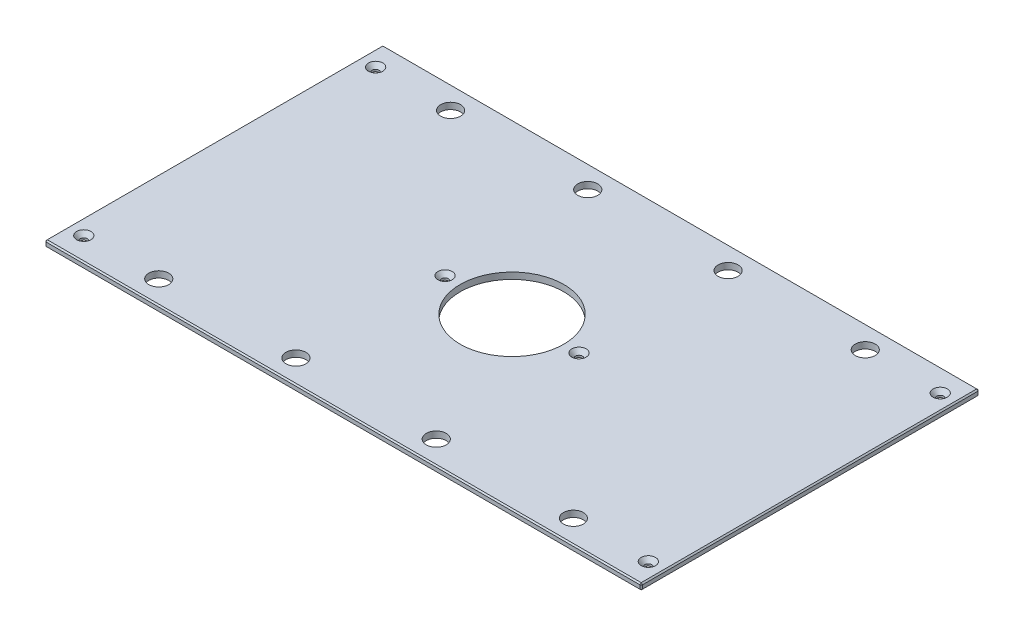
from build123d import *

# Parameters (mm, degrees)
SKETCH1_W                                     = 593.725
SKETCH1_H                                     = 336.55
BOSS_EXTRUDE1_DEPTH                           = 6.35
SKETCH13_R                                    = 51.562
CUT_EXTRUDE6_DEPTH                            = 342.297732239
F_25_32_0_78125_DIAMETER_HOLE1_D              = 19.84375
CHAMFER2_SIZE                                 = 1.27
CSK_FOR_1_4_FLAT_HEAD_MACHINE_SCREW1_AT_COUNT = 2
CSK_FOR_1_4_FLAT_HEAD_MACHINE_SCREW1_AT_PITCH = 290.50996
CSK_FOR_1_4_FLAT_HEAD_MACHINE_SCREW1_2_COUNT  = 2
CSK_FOR_1_4_FLAT_HEAD_MACHINE_SCREW1_2_PITCH  = 632.623061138
CSK_FOR_1_4_FLAT_HEAD_MACHINE_SCREW1_3_COUNT  = 2
CSK_FOR_1_4_FLAT_HEAD_MACHINE_SCREW1_3_PITCH  = 376.786707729
CSK_FOR_1_4_FLAT_HEAD_MACHINE_SCREW1_4_COUNT  = 2
CSK_FOR_1_4_FLAT_HEAD_MACHINE_SCREW1_4_PITCH  = 258.89931802
CSK_FOR_1_4_FLAT_HEAD_MACHINE_SCREW1_5_COUNT  = 2
CSK_FOR_1_4_FLAT_HEAD_MACHINE_SCREW1_5_PITCH  = 561.975
CSK_FOR_1_4_FLAT_HEAD_MACHINE_SCREW1_6_COUNT  = 2
CSK_FOR_1_4_FLAT_HEAD_MACHINE_SCREW1_6_PITCH  = 487.3625
CSK_FOR_1_4_FLAT_HEAD_MACHINE_SCREW1_7_COUNT  = 2
CSK_FOR_1_4_FLAT_HEAD_MACHINE_SCREW1_7_PITCH  = 567.378395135


with BuildPart() as part:
    # Sketch1 → Boss-Extrude1 (new body)
    with BuildSketch(Plane(origin=(0, 0, 0), x_dir=(1, 0, 0), z_dir=(0, 1, 0))):
        Rectangle(SKETCH1_W, SKETCH1_H)
    extrude(amount=BOSS_EXTRUDE1_DEPTH)

    # Sketch13 → Cut-Extrude6 (cut, through all)
    with BuildSketch(Plane(origin=(0, 6.35, 0), x_dir=(1, 0, 0), z_dir=(0, 1, 0))):
        with Locations(Location((0, 0, 0), (0, 0, 270))):
            Circle(SKETCH13_R)
    extrude(amount=-CUT_EXTRUDE6_DEPTH, mode=Mode.SUBTRACT)

    # 25_32 _0.78125_ Diameter Hole1 (through all)
    with Locations(Plane(origin=(0, 6.35, 0), x_dir=(1, 0, 0), z_dir=(0, 1, 0))):
        with Locations((206.375, 145.25498), (-206.375, 145.25498), (206.375, -145.25498), (-206.375, -145.25498), (-69.85, 145.25498), (69.85, 145.25498), (69.85, -145.25498), (-69.85, -145.25498)):
            Hole(F_25_32_0_78125_DIAMETER_HOLE1_D / 2)

    # Chamfer2
    chamfer2_edges = [part.edges().sort_by_distance(p)[0] for p in [
        (296.8625, 6.35, 0),
        (0, 6.35, -168.275),
        (-296.8625, 6.35, 0),
        (0, 0, -168.275),
        (296.8625, 0, 0),
        (0, 0, 168.275),
        (-296.8625, 0, 0),
        (0, 6.35, 168.275),
        (-296.8625, 3.175, -168.275),
        (296.8625, 3.175, -168.275),
        (296.8625, 3.175, 168.275),
        (-296.8625, 3.175, 168.275),
    ]]
    chamfer(chamfer2_edges, length=CHAMFER2_SIZE)

    # Sketch24 → CSK for 1_4 Flat Head Machine Screw1 (revolve, cut)
    with BuildSketch(Plane(origin=(280.9875, 6.35, -145.25498), x_dir=(0, 0, 1), z_dir=(1, 0, 0))):
        Polygon((0, 0), (0, 6.35), (3.3782, 6.35), (3.3782, 4.324464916), (7.1374, 0), align=None)
    csk_for_1_4_flat_head_machine_screw1 = revolve(axis=Axis((280.9875, 12.7, -145.25498), (0, -1, 0)), mode=Mode.SUBTRACT)

    # CSK for 1_4 Flat Head Machine Screw1 at: CSK for 1_4 Flat Head Machine Screw1 ×2
    with Locations(*[(0, 0, i * CSK_FOR_1_4_FLAT_HEAD_MACHINE_SCREW1_AT_PITCH) for i in range(1, CSK_FOR_1_4_FLAT_HEAD_MACHINE_SCREW1_AT_COUNT)]):
        add(csk_for_1_4_flat_head_machine_screw1, mode=Mode.SUBTRACT)

    # CSK for 1_4 Flat Head Machine Screw1 2: CSK for 1_4 Flat Head Machine Screw1 ×2
    with Locations(*[Vector(-0.8883251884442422, 0, 0.45921493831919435) * (i * CSK_FOR_1_4_FLAT_HEAD_MACHINE_SCREW1_2_PITCH) for i in range(1, CSK_FOR_1_4_FLAT_HEAD_MACHINE_SCREW1_2_COUNT)]):
        add(csk_for_1_4_flat_head_machine_screw1, mode=Mode.SUBTRACT)

    # CSK for 1_4 Flat Head Machine Screw1 3: CSK for 1_4 Flat Head Machine Screw1 ×2
    with Locations(*[Vector(-0.9227037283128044, 0, 0.3855098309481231) * (i * CSK_FOR_1_4_FLAT_HEAD_MACHINE_SCREW1_3_PITCH) for i in range(1, CSK_FOR_1_4_FLAT_HEAD_MACHINE_SCREW1_3_COUNT)]):
        add(csk_for_1_4_flat_head_machine_screw1, mode=Mode.SUBTRACT)

    # CSK for 1_4 Flat Head Machine Screw1 4: CSK for 1_4 Flat Head Machine Screw1 ×2
    with Locations(*[Vector(-0.827783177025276, 0, 0.5610481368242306) * (i * CSK_FOR_1_4_FLAT_HEAD_MACHINE_SCREW1_4_PITCH) for i in range(1, CSK_FOR_1_4_FLAT_HEAD_MACHINE_SCREW1_4_COUNT)]):
        add(csk_for_1_4_flat_head_machine_screw1, mode=Mode.SUBTRACT)

    # CSK for 1_4 Flat Head Machine Screw1 5: CSK for 1_4 Flat Head Machine Screw1 ×2
    with Locations(*[(-i * CSK_FOR_1_4_FLAT_HEAD_MACHINE_SCREW1_5_PITCH, 0, 0) for i in range(1, CSK_FOR_1_4_FLAT_HEAD_MACHINE_SCREW1_5_COUNT)]):
        add(csk_for_1_4_flat_head_machine_screw1, mode=Mode.SUBTRACT)

    # CSK for 1_4 Flat Head Machine Screw1 6: CSK for 1_4 Flat Head Machine Screw1 ×2
    with Locations(*[(-i * CSK_FOR_1_4_FLAT_HEAD_MACHINE_SCREW1_6_PITCH, 0, 0) for i in range(1, CSK_FOR_1_4_FLAT_HEAD_MACHINE_SCREW1_6_COUNT)]):
        add(csk_for_1_4_flat_head_machine_screw1, mode=Mode.SUBTRACT)

    # CSK for 1_4 Flat Head Machine Screw1 7: CSK for 1_4 Flat Head Machine Screw1 ×2
    with Locations(*[Vector(-0.8589726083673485, 0, 0.5120215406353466) * (i * CSK_FOR_1_4_FLAT_HEAD_MACHINE_SCREW1_7_PITCH) for i in range(1, CSK_FOR_1_4_FLAT_HEAD_MACHINE_SCREW1_7_COUNT)]):
        add(csk_for_1_4_flat_head_machine_screw1, mode=Mode.SUBTRACT)


solid = part.part
